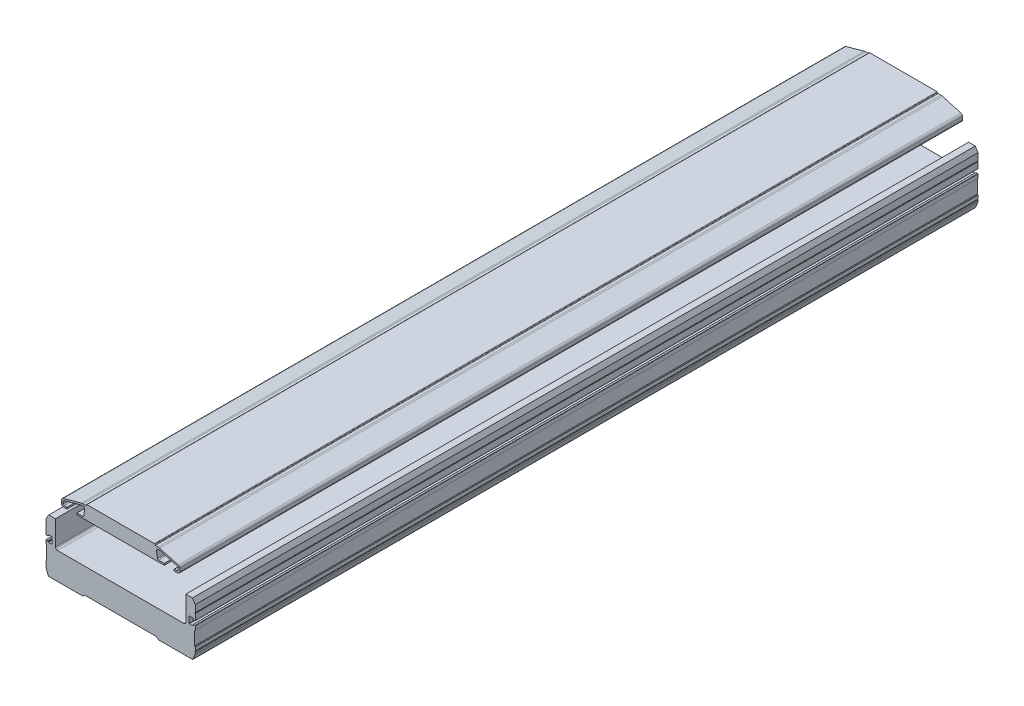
from build123d import *

# Parameters (mm, degrees)
EXTRUDE_1_DEPTH             = 708
EXTRUDE_1_2_DEPTH           = 708
HOLE_WIZARD_1_AT_2_COUNT    = 2
HOLE_WIZARD_1_AT_2_PITCH    = 200
HOLE_WIZARD_1_AT_3_COUNT    = 2
HOLE_WIZARD_1_AT_3_PITCH    = 600
HOLE_WIZARD_1_AT_4_COUNT    = 2
HOLE_WIZARD_1_AT_4_PITCH    = 400
HOLE_WIZARD_1_AT_5_COUNT    = 2
HOLE_WIZARD_1_AT_5_PITCH    = 413.806718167
HOLE_WIZARD_1_AT_6_COUNT    = 2
HOLE_WIZARD_1_AT_6_PITCH    = 609.2913917
HOLE_WIZARD_1_AT_7_COUNT    = 2
HOLE_WIZARD_1_AT_7_PITCH    = 226.353705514
HOLE_WIZARD_1_AT_8_COUNT    = 2
HOLE_WIZARD_1_AT_8_PITCH    = 106
HOLE_WIZARD_M6_1_AT_2_COUNT = 2
HOLE_WIZARD_M6_1_AT_2_PITCH = 106
HOLE_WIZARD_M6_1_AT_3_COUNT = 2
HOLE_WIZARD_M6_1_AT_3_PITCH = 200
HOLE_WIZARD_M6_1_AT_4_COUNT = 2
HOLE_WIZARD_M6_1_AT_4_PITCH = 400
HOLE_WIZARD_M6_1_AT_5_COUNT = 2
HOLE_WIZARD_M6_1_AT_5_PITCH = 600
HOLE_WIZARD_M6_1_AT_6_COUNT = 2
HOLE_WIZARD_M6_1_AT_6_PITCH = 609.2913917
HOLE_WIZARD_M6_1_AT_7_COUNT = 2
HOLE_WIZARD_M6_1_AT_7_PITCH = 413.806718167
HOLE_WIZARD_M6_1_AT_8_COUNT = 2
HOLE_WIZARD_M6_1_AT_8_PITCH = 226.353705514


with BuildPart() as part:
    # Sketch 1 → Extrude 1 (new body)
    with BuildSketch(Plane.XY):
        with BuildLine():
            Line((-51.499999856, 59.400000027), (-48.499999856, 59.400000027))
            Line((-48.499999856, 59.400000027), (-48.499999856, 60.900000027))
            Line((-48.499999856, 60.900000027), (-50.999999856, 60.900000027))
            ThreePointArc((-50.999999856, 60.900000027), (-51.707106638, 61.192893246), (-51.999999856, 61.900000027))
            Line((-51.999999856, 61.900000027), (-51.999999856, 63.704621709))
            ThreePointArc((-51.999999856, 63.704621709), (-51.796871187, 64.308770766), (-51.27000769, 64.667479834))
            Line((-51.27000769, 64.667479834), (-35.04852954, 69.21635995))
            ThreePointArc((-35.04852954, 69.21635995), (-33.17193273, 68.778444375), (-32.536146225, 66.959334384))
            Line((-32.536146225, 66.959334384), (-33.413816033, 61.73434537))
            ThreePointArc((-33.413816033, 61.73434537), (-33.754110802, 61.136568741), (-34.399999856, 60.900000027))
            Line((-34.399999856, 60.900000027), (-39.499999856, 60.900000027))
            Line((-39.499999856, 60.900000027), (-39.499999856, 59.400000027))
            Line((-39.499999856, 59.400000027), (39.500000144, 59.400000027))
            Line((39.500000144, 59.400000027), (39.500000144, 60.900000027))
            Line((39.500000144, 60.900000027), (34.400000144, 60.900000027))
            ThreePointArc((34.400000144, 60.900000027), (33.754111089, 61.136568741), (33.41381632, 61.73434537))
            Line((33.41381632, 61.73434537), (32.536146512, 66.959334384))
            ThreePointArc((32.536146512, 66.959334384), (33.171933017, 68.778444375), (35.048529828, 69.21635995))
            Line((35.048529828, 69.21635995), (51.270007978, 64.667479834))
            ThreePointArc((51.270007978, 64.667479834), (51.796871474, 64.308770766), (52.000000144, 63.704621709))
            Line((52.000000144, 63.704621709), (52.000000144, 61.900000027))
            ThreePointArc((52.000000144, 61.900000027), (51.707106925, 61.192893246), (51.000000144, 60.900000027))
            Line((51.000000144, 60.900000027), (48.500000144, 60.900000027))
            Line((48.500000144, 60.900000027), (48.500000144, 59.400000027))
            Line((48.500000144, 59.400000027), (51.500000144, 59.400000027))
            ThreePointArc((51.500000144, 59.400000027), (52.914213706, 59.985786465), (53.500000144, 61.400000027))
            Line((53.500000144, 61.400000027), (53.500000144, 64.083697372))
            ThreePointArc((53.500000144, 64.083697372), (53.093742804, 65.291995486), (52.040015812, 66.009413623))
            Line((52.040015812, 66.009413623), (35.262246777, 70.714290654))
            ThreePointArc((35.262246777, 70.714290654), (34.593583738, 70.853355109), (33.912207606, 70.900000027))
            Line((33.912207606, 70.900000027), (31.500000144, 70.900000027))
            ThreePointArc((31.500000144, 70.900000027), (31.146446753, 71.046446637), (31.000000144, 71.400000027))
            ThreePointArc((31.000000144, 71.400000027), (30.853553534, 71.753553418), (30.500000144, 71.900000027))
            Line((30.500000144, 71.900000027), (-30.499999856, 71.900000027))
            ThreePointArc((-30.499999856, 71.900000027), (-30.853553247, 71.753553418), (-30.999999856, 71.400000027))
            ThreePointArc((-30.999999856, 71.400000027), (-31.146446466, 71.046446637), (-31.499999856, 70.900000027))
            Line((-31.499999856, 70.900000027), (-33.912207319, 70.900000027))
            ThreePointArc((-33.912207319, 70.900000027), (-34.593583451, 70.853355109), (-35.262246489, 70.714290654))
            Line((-35.262246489, 70.714290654), (-52.040015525, 66.009413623))
            ThreePointArc((-52.040015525, 66.009413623), (-53.093742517, 65.291995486), (-53.499999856, 64.083697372))
            Line((-53.499999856, 64.083697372), (-53.499999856, 61.400000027))
            ThreePointArc((-53.499999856, 61.400000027), (-52.914213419, 59.985786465), (-51.499999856, 59.400000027))
        make_face()
    extrude(amount=EXTRUDE_1_DEPTH)


with BuildPart() as body_2:
    # Sketch 1 → Extrude 1 2 (new body)
    with BuildSketch(Plane.XY):
        with BuildLine():
            Line((-65.16, -1.6), (-34.1, -1.6))
            Line((-34.1, -1.6), (-32.5, 0))
            Line((-32.5, 0), (32.5, 0))
            Line((32.5, 0), (34.1, -1.6))
            Line((34.1, -1.6), (65.16, -1.6))
            ThreePointArc((65.16, -1.6), (65.35722349, -1.328991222), (65.506419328, -1.028852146))
            Line((65.506419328, -1.028852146), (67.359978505, 3.646795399))
            ThreePointArc((67.359978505, 3.646795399), (67.464610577, 4.00739535), (67.499999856, 4.381197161))
            Line((67.499999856, 4.381197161), (67.499999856, 5.625000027))
            ThreePointArc((67.499999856, 5.625000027), (67.124999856, 6.000000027), (67.499999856, 6.375000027))
            Line((67.499999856, 6.375000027), (67.499999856, 9.500000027))
            Line((67.499999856, 9.500000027), (66.999999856, 10.000000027))
            Line((66.999999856, 10.000000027), (66.999999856, 22.000000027))
            Line((66.999999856, 22.000000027), (67.499999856, 22.500000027))
            Line((67.499999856, 22.500000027), (67.499999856, 25.900000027))
            ThreePointArc((67.499999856, 25.900000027), (67.412131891, 26.112132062), (67.199999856, 26.200000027))
            Line((67.199999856, 26.200000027), (65.799999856, 26.200000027))
            ThreePointArc((65.799999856, 26.200000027), (65.587867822, 26.112132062), (65.499999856, 25.900000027))
            Line((65.499999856, 25.900000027), (65.499999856, 25.300000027))
            ThreePointArc((65.499999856, 25.300000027), (65.412131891, 25.087867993), (65.199999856, 25.000000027))
            Line((65.199999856, 25.000000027), (62.299999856, 25.000000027))
            ThreePointArc((62.299999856, 25.000000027), (62.087867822, 25.087867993), (61.999999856, 25.300000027))
            Line((61.999999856, 25.300000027), (61.999999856, 30.700000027))
            ThreePointArc((61.999999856, 30.700000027), (62.087867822, 30.912132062), (62.299999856, 31.000000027))
            Line((62.299999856, 31.000000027), (65.199999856, 31.000000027))
            ThreePointArc((65.199999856, 31.000000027), (65.412131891, 30.912132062), (65.499999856, 30.700000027))
            Line((65.499999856, 30.700000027), (65.499999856, 30.100000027))
            ThreePointArc((65.499999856, 30.100000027), (65.587867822, 29.887867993), (65.799999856, 29.800000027))
            Line((65.799999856, 29.800000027), (67.199999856, 29.800000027))
            ThreePointArc((67.199999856, 29.800000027), (67.412131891, 29.887867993), (67.499999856, 30.100000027))
            Line((67.499999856, 30.100000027), (67.499999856, 35.625000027))
            ThreePointArc((67.499999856, 35.625000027), (67.124999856, 36.000000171), (67.500000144, 36.375000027))
            Line((67.500000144, 36.375000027), (67.500000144, 42.600000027))
            Line((67.500000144, 42.600000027), (65.000000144, 46.600000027))
            Line((65.000000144, 46.600000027), (59.000000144, 46.600000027))
            Line((59.000000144, 46.600000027), (59.000000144, 24.700000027))
            ThreePointArc((59.000000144, 24.700000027), (58.414213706, 23.285786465), (57.000000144, 22.700000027))
            Line((57.000000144, 22.700000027), (-56.999999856, 22.700000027))
            ThreePointArc((-56.999999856, 22.700000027), (-58.414213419, 23.285786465), (-58.999999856, 24.700000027))
            Line((-58.999999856, 24.700000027), (-58.999999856, 46.600000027))
            Line((-58.999999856, 46.600000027), (-64.999999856, 46.600000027))
            Line((-64.999999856, 46.600000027), (-67.499999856, 42.600000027))
            Line((-67.499999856, 42.600000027), (-67.499999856, 36.375000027))
            ThreePointArc((-67.499999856, 36.375000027), (-67.124999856, 36.000000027), (-67.499999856, 35.625000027))
            Line((-67.499999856, 35.625000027), (-67.499999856, 30.100000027))
            ThreePointArc((-67.499999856, 30.100000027), (-67.412131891, 29.887867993), (-67.199999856, 29.800000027))
            Line((-67.199999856, 29.800000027), (-65.799999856, 29.800000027))
            ThreePointArc((-65.799999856, 29.800000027), (-65.587867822, 29.887867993), (-65.499999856, 30.100000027))
            Line((-65.499999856, 30.100000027), (-65.499999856, 30.700000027))
            ThreePointArc((-65.499999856, 30.700000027), (-65.412131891, 30.912132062), (-65.199999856, 31.000000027))
            Line((-65.199999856, 31.000000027), (-62.299999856, 31.000000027))
            ThreePointArc((-62.299999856, 31.000000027), (-62.087867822, 30.912132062), (-61.999999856, 30.700000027))
            Line((-61.999999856, 30.700000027), (-61.999999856, 25.300000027))
            ThreePointArc((-61.999999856, 25.300000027), (-62.087867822, 25.087867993), (-62.299999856, 25.000000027))
            Line((-62.299999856, 25.000000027), (-65.199999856, 25.000000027))
            ThreePointArc((-65.199999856, 25.000000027), (-65.412131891, 25.087867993), (-65.499999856, 25.300000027))
            Line((-65.499999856, 25.300000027), (-65.499999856, 25.900000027))
            ThreePointArc((-65.499999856, 25.900000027), (-65.587867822, 26.112132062), (-65.799999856, 26.200000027))
            Line((-65.799999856, 26.200000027), (-67.199999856, 26.200000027))
            ThreePointArc((-67.199999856, 26.200000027), (-67.412131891, 26.112132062), (-67.499999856, 25.900000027))
            Line((-67.499999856, 25.900000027), (-67.499999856, 22.500000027))
            Line((-67.499999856, 22.500000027), (-66.999999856, 22.000000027))
            Line((-66.999999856, 22.000000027), (-66.999999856, 10.000000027))
            Line((-66.999999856, 10.000000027), (-67.499999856, 9.500000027))
            Line((-67.499999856, 9.500000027), (-67.499999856, 6.375000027))
            ThreePointArc((-67.499999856, 6.375000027), (-67.124999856, 6.000000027), (-67.499999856, 5.625000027))
            Line((-67.499999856, 5.625000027), (-67.499999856, 4.381197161))
            ThreePointArc((-67.499999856, 4.381197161), (-67.464610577, 4.00739535), (-67.359978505, 3.646795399))
            Line((-67.359978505, 3.646795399), (-65.506419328, -1.028852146))
            ThreePointArc((-65.506419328, -1.028852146), (-65.35722349, -1.328991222), (-65.16, -1.6))
        make_face()
    extrude(amount=EXTRUDE_1_2_DEPTH)

    # Sketch 5 → Hole Wizard 1 (revolve, cut)
    with BuildSketch(Plane(origin=(-53, 46.600000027, 61.5), x_dir=(0, 0, 1), z_dir=(1, 0, 0))):
        Polygon((0, 0), (0, 48.200000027), (3.5, 48.200000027), (3.5, 40.9), (5.5, 40.9), (5.5, 0), align=None)
    hole_wizard_1 = revolve(axis=Axis((-53, 52.950000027, 61.5), (0, -1, 0)), mode=Mode.SUBTRACT)

    # Hole Wizard 1 at 2: Hole Wizard 1 ×2
    with Locations(*[(0, 0, i * HOLE_WIZARD_1_AT_2_PITCH) for i in range(1, HOLE_WIZARD_1_AT_2_COUNT)]):
        add(hole_wizard_1, mode=Mode.SUBTRACT)

    # Hole Wizard 1 at 3: Hole Wizard 1 ×2
    with Locations(*[(0, 0, i * HOLE_WIZARD_1_AT_3_PITCH) for i in range(1, HOLE_WIZARD_1_AT_3_COUNT)]):
        add(hole_wizard_1, mode=Mode.SUBTRACT)

    # Hole Wizard 1 at 4: Hole Wizard 1 ×2
    with Locations(*[(0, 0, i * HOLE_WIZARD_1_AT_4_PITCH) for i in range(1, HOLE_WIZARD_1_AT_4_COUNT)]):
        add(hole_wizard_1, mode=Mode.SUBTRACT)

    # Hole Wizard 1 at 5: Hole Wizard 1 ×2
    with Locations(*[Vector(0.25615823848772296, 4.383941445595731e-14, 0.9666348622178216) * (i * HOLE_WIZARD_1_AT_5_PITCH) for i in range(1, HOLE_WIZARD_1_AT_5_COUNT)]):
        add(hole_wizard_1, mode=Mode.SUBTRACT)

    # Hole Wizard 1 at 6: Hole Wizard 1 ×2
    with Locations(*[Vector(0.17397258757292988, 2.9774003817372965e-14, 0.9847504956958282) * (i * HOLE_WIZARD_1_AT_6_PITCH) for i in range(1, HOLE_WIZARD_1_AT_6_COUNT)]):
        add(hole_wizard_1, mode=Mode.SUBTRACT)

    # Hole Wizard 1 at 7: Hole Wizard 1 ×2
    with Locations(*[Vector(0.4682936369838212, 8.014467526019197e-14, 0.8835728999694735) * (i * HOLE_WIZARD_1_AT_7_PITCH) for i in range(1, HOLE_WIZARD_1_AT_7_COUNT)]):
        add(hole_wizard_1, mode=Mode.SUBTRACT)

    # Hole Wizard 1 at 8: Hole Wizard 1 ×2
    with Locations(*[(i * HOLE_WIZARD_1_AT_8_PITCH, 0, 0) for i in range(1, HOLE_WIZARD_1_AT_8_COUNT)]):
        add(hole_wizard_1, mode=Mode.SUBTRACT)

    # Sketch 9 → Hole Wizard M6 _1 (revolve, cut)
    with BuildSketch(Plane(origin=(53, -1.6, 51.5), x_dir=(0, 0, -1), z_dir=(1, 0, 0))):
        Polygon((0, 0), (0, 12.502151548), (2.5, 11), (2.5, 0), align=None)
    hole_wizard_m6_1 = revolve(axis=Axis((53, -7.95, 51.5), (0, 1, 0)), mode=Mode.SUBTRACT)

    # Hole Wizard M6 _1 at 2: Hole Wizard M6 _1 ×2
    with Locations(*[(-i * HOLE_WIZARD_M6_1_AT_2_PITCH, 0, 0) for i in range(1, HOLE_WIZARD_M6_1_AT_2_COUNT)]):
        add(hole_wizard_m6_1, mode=Mode.SUBTRACT)

    # Hole Wizard M6 _1 at 3: Hole Wizard M6 _1 ×2
    with Locations(*[(0, 0, i * HOLE_WIZARD_M6_1_AT_3_PITCH) for i in range(1, HOLE_WIZARD_M6_1_AT_3_COUNT)]):
        add(hole_wizard_m6_1, mode=Mode.SUBTRACT)

    # Hole Wizard M6 _1 at 4: Hole Wizard M6 _1 ×2
    with Locations(*[(0, 0, i * HOLE_WIZARD_M6_1_AT_4_PITCH) for i in range(1, HOLE_WIZARD_M6_1_AT_4_COUNT)]):
        add(hole_wizard_m6_1, mode=Mode.SUBTRACT)

    # Hole Wizard M6 _1 at 5: Hole Wizard M6 _1 ×2
    with Locations(*[(0, 0, i * HOLE_WIZARD_M6_1_AT_5_PITCH) for i in range(1, HOLE_WIZARD_M6_1_AT_5_COUNT)]):
        add(hole_wizard_m6_1, mode=Mode.SUBTRACT)

    # Hole Wizard M6 _1 at 6: Hole Wizard M6 _1 ×2
    with Locations(*[Vector(-0.17397258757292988, 0, 0.9847504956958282) * (i * HOLE_WIZARD_M6_1_AT_6_PITCH) for i in range(1, HOLE_WIZARD_M6_1_AT_6_COUNT)]):
        add(hole_wizard_m6_1, mode=Mode.SUBTRACT)

    # Hole Wizard M6 _1 at 7: Hole Wizard M6 _1 ×2
    with Locations(*[Vector(-0.25615823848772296, 0, 0.9666348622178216) * (i * HOLE_WIZARD_M6_1_AT_7_PITCH) for i in range(1, HOLE_WIZARD_M6_1_AT_7_COUNT)]):
        add(hole_wizard_m6_1, mode=Mode.SUBTRACT)

    # Hole Wizard M6 _1 at 8: Hole Wizard M6 _1 ×2
    with Locations(*[Vector(-0.4682936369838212, 0, 0.8835728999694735) * (i * HOLE_WIZARD_M6_1_AT_8_PITCH) for i in range(1, HOLE_WIZARD_M6_1_AT_8_COUNT)]):
        add(hole_wizard_m6_1, mode=Mode.SUBTRACT)


solid = Compound([part.part, body_2.part])
